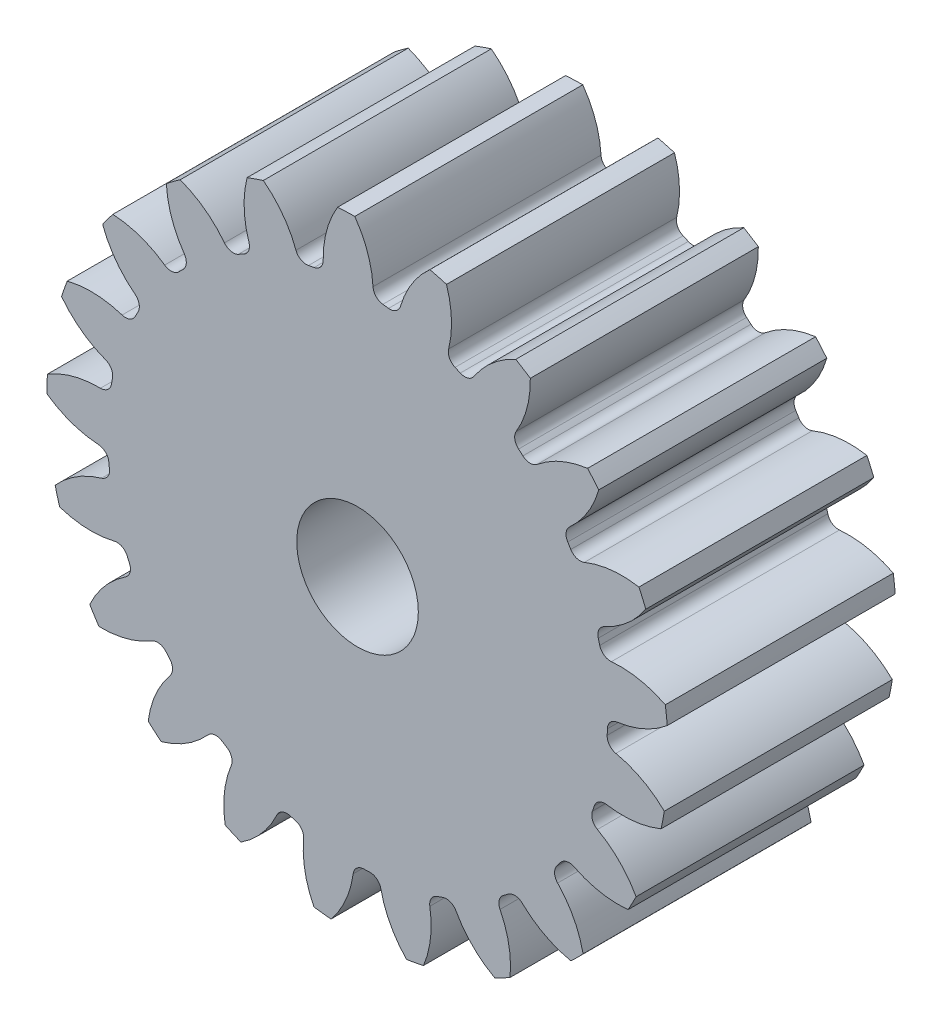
from build123d import *

# Parameters (mm, degrees)
SKETCH3_R         = 129.822222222
GEARBODY_DEPTH    = 95.25
TOOTHCUT_DEPTH    = 207.833704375
CIRPATTERN1_COUNT = 21
BOREDIA_R         = 25.4
BORE_DEPTH        = 12700


with BuildPart() as part:
    # Sketch3 → gearBody (new body)
    with BuildSketch(Plane.XY):
        Circle(SKETCH3_R)
    extrude(amount=GEARBODY_DEPTH)

    # Sketch2 → toothCut (cut, through all)
    with BuildSketch(Plane.XY):
        with BuildLine():
            ThreePointArc((104.292966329, -5.194003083), (104.345766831, -3.995176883), (104.384787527, -2.795823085))
            ThreePointArc((104.384787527, -2.795823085), (105.561695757, 0.153771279), (108.370584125, 1.635448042))
            ThreePointArc((108.370584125, 1.635448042), (119.792439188, 4.877689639), (129.822222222, 11.231771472))
            ThreePointArc((129.822222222, 11.231771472), (130.21177578, -4.985531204), (128.583328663, -21.125568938))
            ThreePointArc((128.583328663, -21.125568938), (119.06876536, -14.023175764), (107.928262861, -9.917069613))
            ThreePointArc((107.928262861, -9.917069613), (105.24089228, -8.224952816), (104.292966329, -5.194003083))
        make_face()
    toothcut = extrude(amount=TOOTHCUT_DEPTH, mode=Mode.SUBTRACT)

    # CirPattern1: toothCut ×21 about axis
    cirpattern1_axis = Axis((0, 0, 0), (0, 0, 1))
    for i in range(1, CIRPATTERN1_COUNT):
        add(toothcut.rotate(cirpattern1_axis, i * 360 / CIRPATTERN1_COUNT), mode=Mode.SUBTRACT)

    # boreDia → bore (cut, symmetric)
    with BuildSketch(Plane.XY):
        Circle(BOREDIA_R)
    extrude(amount=BORE_DEPTH, both=True, mode=Mode.SUBTRACT)


solid = part.part
